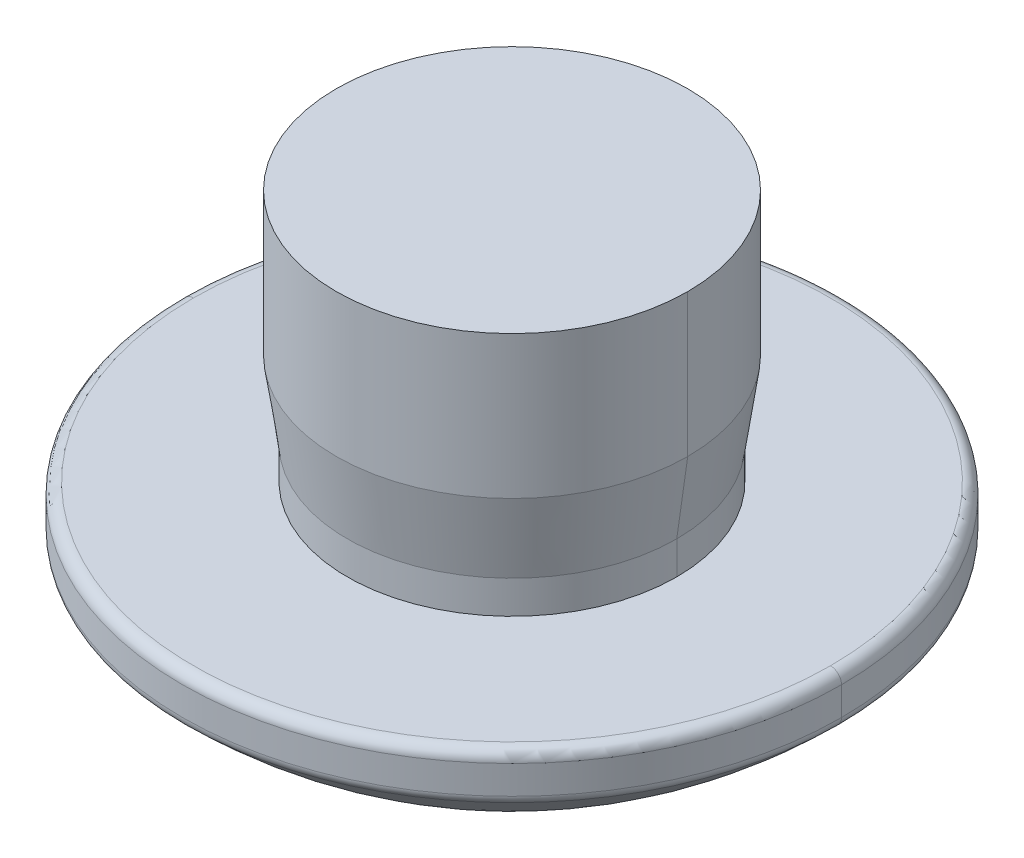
ISO-10303-21;
HEADER;
FILE_DESCRIPTION(('STEP AP214'),'2;1');
FILE_NAME('part.step','',(''),(''),'','','');
FILE_SCHEMA(('AUTOMOTIVE_DESIGN { 1 0 10303 214 1 1 1 1 }'));
ENDSEC;
DATA;
#1=APPLICATION_CONTEXT('core data for automotive mechanical design processes');
#2=APPLICATION_PROTOCOL_DEFINITION('international standard','automotive_design',2000,#1);
#3=PRODUCT_CONTEXT('',#1,'mechanical');
#4=PRODUCT('Part','Part','',(#3));
#5=PRODUCT_RELATED_PRODUCT_CATEGORY('part','',(#4));
#6=PRODUCT_DEFINITION_FORMATION('','',#4);
#7=PRODUCT_DEFINITION_CONTEXT('part definition',#1,'design');
#8=PRODUCT_DEFINITION('design','',#6,#7);
#9=PRODUCT_DEFINITION_SHAPE('','',#8);
#10=(LENGTH_UNIT() NAMED_UNIT(*) SI_UNIT(.MILLI.,.METRE.));
#11=(NAMED_UNIT(*) PLANE_ANGLE_UNIT() SI_UNIT($,.RADIAN.));
#12=(NAMED_UNIT(*) SI_UNIT($,.STERADIAN.) SOLID_ANGLE_UNIT());
#13=UNCERTAINTY_MEASURE_WITH_UNIT(LENGTH_MEASURE(1.E-05),#10,'distance_accuracy_value','');
#14=(GEOMETRIC_REPRESENTATION_CONTEXT(3) GLOBAL_UNCERTAINTY_ASSIGNED_CONTEXT((#13)) GLOBAL_UNIT_ASSIGNED_CONTEXT((#10,
#11,#12)) REPRESENTATION_CONTEXT('',''));
#15=CARTESIAN_POINT('',(0.,0.,0.));
#16=DIRECTION('',(0.,0.,1.));
#17=DIRECTION('',(1.,0.,0.));
#18=AXIS2_PLACEMENT_3D('',#15,#16,#17);
#19=CARTESIAN_POINT('',(16.8911017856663,13.2171733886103,17.2699844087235));
#20=DIRECTION('',(0.,-1.,0.));
#21=DIRECTION('',(-1.,0.,0.));
#22=AXIS2_PLACEMENT_3D('',#19,#20,#21);
#23=TOROIDAL_SURFACE('',#22,2.10103469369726,0.5);
#24=CARTESIAN_POINT('',(18.9921364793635,13.2171733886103,17.2699844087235));
#25=DIRECTION('',(0.,0.,-1.));
#26=DIRECTION('',(1.,0.,0.));
#27=AXIS2_PLACEMENT_3D('',#24,#25,#26);
#28=CIRCLE('',#27,0.5);
#29=CARTESIAN_POINT('',(19.2738215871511,12.8040711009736,17.2699844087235));
#30=VERTEX_POINT('',#29);
#31=CARTESIAN_POINT('',(18.9921364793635,12.7171733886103,17.2699844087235));
#32=VERTEX_POINT('',#31);
#33=EDGE_CURVE('E156',#30,#32,#28,.T.);
#34=ORIENTED_EDGE('',*,*,#33,.F.);
#35=CARTESIAN_POINT('',(16.8911017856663,12.8040711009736,17.2699844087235));
#36=DIRECTION('',(0.,1.,0.));
#37=DIRECTION('',(1.,0.,0.));
#38=AXIS2_PLACEMENT_3D('',#35,#36,#37);
#39=CIRCLE('',#38,2.38271980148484);
#40=CARTESIAN_POINT('',(16.8911017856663,12.8040711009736,19.6527042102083));
#41=VERTEX_POINT('',#40);
#42=EDGE_CURVE('E19',#41,#30,#39,.T.);
#43=ORIENTED_EDGE('',*,*,#42,.F.);
#44=CARTESIAN_POINT('',(16.8911017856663,12.8040711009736,17.2699844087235));
#45=DIRECTION('',(0.,1.,0.));
#46=DIRECTION('',(1.,0.,0.));
#47=AXIS2_PLACEMENT_3D('',#44,#45,#46);
#48=CIRCLE('',#47,2.38271980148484);
#49=CARTESIAN_POINT('',(14.5083819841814,12.8040711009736,17.2699844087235));
#50=VERTEX_POINT('',#49);
#51=EDGE_CURVE('E250',#50,#41,#48,.T.);
#52=ORIENTED_EDGE('',*,*,#51,.F.);
#53=CARTESIAN_POINT('',(14.790067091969,13.2171733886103,17.2699844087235));
#54=DIRECTION('',(0.,0.,1.));
#55=DIRECTION('',(0.,1.,0.));
#56=AXIS2_PLACEMENT_3D('',#53,#54,#55);
#57=CIRCLE('',#56,0.5);
#58=CARTESIAN_POINT('',(14.790067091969,12.7171733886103,17.2699844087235));
#59=VERTEX_POINT('',#58);
#60=EDGE_CURVE('E184',#50,#59,#57,.T.);
#61=ORIENTED_EDGE('',*,*,#60,.T.);
#62=CARTESIAN_POINT('',(16.8911017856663,12.7171733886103,17.2699844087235));
#63=DIRECTION('',(0.,-1.,0.));
#64=DIRECTION('',(-1.,0.,0.));
#65=AXIS2_PLACEMENT_3D('',#62,#63,#64);
#66=CIRCLE('',#65,2.10103469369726);
#67=EDGE_CURVE('E158',#32,#59,#66,.T.);
#68=ORIENTED_EDGE('',*,*,#67,.F.);
#69=EDGE_LOOP('',(#34,#43,#52,#61,#68));
#70=FACE_BOUND('',#69,.T.);
#71=ADVANCED_FACE('F16',(#70),#23,.T.);
#72=CARTESIAN_POINT('',(16.8911017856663,13.7171733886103,17.2699844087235));
#73=DIRECTION('',(0.,-1.,0.));
#74=DIRECTION('',(0.,0.,-1.));
#75=AXIS2_PLACEMENT_3D('',#72,#73,#74);
#76=PLANE('',#75);
#77=CARTESIAN_POINT('',(16.8911017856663,13.7171733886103,17.2699844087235));
#78=DIRECTION('',(0.,-1.,0.));
#79=DIRECTION('',(-1.,0.,0.));
#80=AXIS2_PLACEMENT_3D('',#77,#78,#79);
#81=CIRCLE('',#80,1.);
#82=CARTESIAN_POINT('',(15.8911017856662,13.7171733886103,17.2699844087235));
#83=VERTEX_POINT('',#82);
#84=CARTESIAN_POINT('',(17.8911017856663,13.7171733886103,17.2699844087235));
#85=VERTEX_POINT('',#84);
#86=EDGE_CURVE('E11',#83,#85,#81,.T.);
#87=ORIENTED_EDGE('',*,*,#86,.T.);
#88=CARTESIAN_POINT('',(16.8911017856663,13.7171733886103,17.2699844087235));
#89=DIRECTION('',(0.,-1.,0.));
#90=DIRECTION('',(-1.,0.,0.));
#91=AXIS2_PLACEMENT_3D('',#88,#89,#90);
#92=CIRCLE('',#91,1.);
#93=EDGE_CURVE('E202',#85,#83,#92,.T.);
#94=ORIENTED_EDGE('',*,*,#93,.T.);
#95=EDGE_LOOP('',(#87,#94));
#96=FACE_BOUND('',#95,.T.);
#97=ADVANCED_FACE('F343',(#96),#76,.T.);
#98=CARTESIAN_POINT('',(16.8911017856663,13.7171733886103,17.2699844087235));
#99=DIRECTION('',(0.,-1.,0.));
#100=DIRECTION('',(-1.,0.,0.));
#101=AXIS2_PLACEMENT_3D('',#98,#99,#100);
#102=CYLINDRICAL_SURFACE('',#101,1.);
#103=DIRECTION('',(0.,-1.,0.));
#104=VECTOR('',#103,1.);
#105=CARTESIAN_POINT('',(17.8911017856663,13.7171733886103,17.2699844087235));
#106=LINE('',#105,#104);
#107=CARTESIAN_POINT('',(17.8911017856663,12.7171733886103,17.2699844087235));
#108=VERTEX_POINT('',#107);
#109=EDGE_CURVE('E206',#85,#108,#106,.T.);
#110=ORIENTED_EDGE('',*,*,#109,.F.);
#111=ORIENTED_EDGE('',*,*,#86,.F.);
#112=DIRECTION('',(0.,-1.,0.));
#113=VECTOR('',#112,1.);
#114=CARTESIAN_POINT('',(15.8911017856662,13.7171733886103,17.2699844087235));
#115=LINE('',#114,#113);
#116=CARTESIAN_POINT('',(15.8911017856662,12.7171733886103,17.2699844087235));
#117=VERTEX_POINT('',#116);
#118=EDGE_CURVE('E223',#83,#117,#115,.T.);
#119=ORIENTED_EDGE('',*,*,#118,.T.);
#120=CARTESIAN_POINT('',(16.8911017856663,12.7171733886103,17.2699844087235));
#121=DIRECTION('',(0.,-1.,0.));
#122=DIRECTION('',(-1.,0.,0.));
#123=AXIS2_PLACEMENT_3D('',#120,#121,#122);
#124=CIRCLE('',#123,1.);
#125=EDGE_CURVE('E310',#117,#108,#124,.T.);
#126=ORIENTED_EDGE('',*,*,#125,.T.);
#127=EDGE_LOOP('',(#110,#111,#119,#126));
#128=FACE_BOUND('',#127,.T.);
#129=ADVANCED_FACE('F347',(#128),#102,.F.);
#130=CARTESIAN_POINT('',(16.8911017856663,13.6171733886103,17.2699844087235));
#131=DIRECTION('',(0.,1.,0.));
#132=DIRECTION('',(1.,0.,0.));
#133=AXIS2_PLACEMENT_3D('',#130,#131,#132);
#134=TOROIDAL_SURFACE('',#133,2.9,0.1);
#135=CARTESIAN_POINT('',(13.9911017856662,13.6171733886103,17.2699844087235));
#136=DIRECTION('',(0.,0.,-1.));
#137=DIRECTION('',(1.,0.,0.));
#138=AXIS2_PLACEMENT_3D('',#135,#136,#137);
#139=CIRCLE('',#138,0.1);
#140=CARTESIAN_POINT('',(13.8911017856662,13.6171733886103,17.2699844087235));
#141=VERTEX_POINT('',#140);
#142=CARTESIAN_POINT('',(13.9911017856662,13.7171733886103,17.2699844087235));
#143=VERTEX_POINT('',#142);
#144=EDGE_CURVE('E185',#141,#143,#139,.T.);
#145=ORIENTED_EDGE('',*,*,#144,.F.);
#146=CARTESIAN_POINT('',(16.8911017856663,13.6171733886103,17.2699844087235));
#147=DIRECTION('',(0.,-1.,0.));
#148=DIRECTION('',(1.,0.,0.));
#149=AXIS2_PLACEMENT_3D('',#146,#147,#148);
#150=CIRCLE('',#149,3.);
#151=CARTESIAN_POINT('',(19.8911017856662,13.6171733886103,17.2699844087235));
#152=VERTEX_POINT('',#151);
#153=EDGE_CURVE('E297',#152,#141,#150,.T.);
#154=ORIENTED_EDGE('',*,*,#153,.F.);
#155=CARTESIAN_POINT('',(19.7911017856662,13.6171733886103,17.2699844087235));
#156=DIRECTION('',(0.,0.,1.));
#157=DIRECTION('',(0.,1.,0.));
#158=AXIS2_PLACEMENT_3D('',#155,#156,#157);
#159=CIRCLE('',#158,0.1);
#160=CARTESIAN_POINT('',(19.7911017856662,13.7171733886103,17.2699844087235));
#161=VERTEX_POINT('',#160);
#162=EDGE_CURVE('E177',#152,#161,#159,.T.);
#163=ORIENTED_EDGE('',*,*,#162,.T.);
#164=CARTESIAN_POINT('',(16.8911017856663,13.7171733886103,17.2699844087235));
#165=DIRECTION('',(0.,1.,0.));
#166=DIRECTION('',(1.,0.,0.));
#167=AXIS2_PLACEMENT_3D('',#164,#165,#166);
#168=CIRCLE('',#167,2.9);
#169=EDGE_CURVE('E207',#143,#161,#168,.T.);
#170=ORIENTED_EDGE('',*,*,#169,.F.);
#171=EDGE_LOOP('',(#145,#154,#163,#170));
#172=FACE_BOUND('',#171,.T.);
#173=ADVANCED_FACE('F353',(#172),#134,.T.);
#174=CARTESIAN_POINT('',(16.8911017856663,13.3587004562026,17.2699844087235));
#175=DIRECTION('',(0.,1.,0.));
#176=DIRECTION('',(1.,0.,0.));
#177=AXIS2_PLACEMENT_3D('',#174,#175,#176);
#178=TOROIDAL_SURFACE('',#177,2.9,0.1);
#179=CARTESIAN_POINT('',(13.9911017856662,13.3587004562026,17.2699844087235));
#180=DIRECTION('',(0.,0.,-1.));
#181=DIRECTION('',(1.,0.,0.));
#182=AXIS2_PLACEMENT_3D('',#179,#180,#181);
#183=CIRCLE('',#182,0.1);
#184=CARTESIAN_POINT('',(13.9208737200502,13.2875104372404,17.2699844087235));
#185=VERTEX_POINT('',#184);
#186=CARTESIAN_POINT('',(13.8911017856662,13.3587004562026,17.2699844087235));
#187=VERTEX_POINT('',#186);
#188=EDGE_CURVE('E215',#185,#187,#183,.T.);
#189=ORIENTED_EDGE('',*,*,#188,.F.);
#190=CARTESIAN_POINT('',(16.8911017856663,13.2875104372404,17.2699844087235));
#191=DIRECTION('',(0.,-1.,0.));
#192=DIRECTION('',(1.,0.,0.));
#193=AXIS2_PLACEMENT_3D('',#190,#191,#192);
#194=CIRCLE('',#193,2.97022806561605);
#195=CARTESIAN_POINT('',(16.8911017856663,13.2875104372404,20.2402124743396));
#196=VERTEX_POINT('',#195);
#197=EDGE_CURVE('E244',#196,#185,#194,.T.);
#198=ORIENTED_EDGE('',*,*,#197,.F.);
#199=CARTESIAN_POINT('',(16.8911017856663,13.2875104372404,17.2699844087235));
#200=DIRECTION('',(0.,-1.,0.));
#201=DIRECTION('',(1.,0.,0.));
#202=AXIS2_PLACEMENT_3D('',#199,#200,#201);
#203=CIRCLE('',#202,2.97022806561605);
#204=CARTESIAN_POINT('',(19.8613298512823,13.2875104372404,17.2699844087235));
#205=VERTEX_POINT('',#204);
#206=EDGE_CURVE('E154',#205,#196,#203,.T.);
#207=ORIENTED_EDGE('',*,*,#206,.F.);
#208=CARTESIAN_POINT('',(19.7911017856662,13.3587004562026,17.2699844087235));
#209=DIRECTION('',(0.,0.,1.));
#210=DIRECTION('',(0.,1.,0.));
#211=AXIS2_PLACEMENT_3D('',#208,#209,#210);
#212=CIRCLE('',#211,0.1);
#213=CARTESIAN_POINT('',(19.8911017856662,13.3587004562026,17.2699844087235));
#214=VERTEX_POINT('',#213);
#215=EDGE_CURVE('E236',#205,#214,#212,.T.);
#216=ORIENTED_EDGE('',*,*,#215,.T.);
#217=CARTESIAN_POINT('',(16.8911017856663,13.3587004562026,17.2699844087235));
#218=DIRECTION('',(0.,1.,0.));
#219=DIRECTION('',(1.,0.,0.));
#220=AXIS2_PLACEMENT_3D('',#217,#218,#219);
#221=CIRCLE('',#220,3.);
#222=EDGE_CURVE('E210',#187,#214,#221,.T.);
#223=ORIENTED_EDGE('',*,*,#222,.F.);
#224=EDGE_LOOP('',(#189,#198,#207,#216,#223));
#225=FACE_BOUND('',#224,.T.);
#226=ADVANCED_FACE('F320',(#225),#178,.T.);
#227=CARTESIAN_POINT('',(16.8911017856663,16.2984233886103,17.2699844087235));
#228=DIRECTION('',(-1.,0.,0.));
#229=DIRECTION('',(0.,0.,1.));
#230=AXIS2_PLACEMENT_3D('',#227,#228,#229);
#231=SPHERICAL_SURFACE('',#230,4.22940321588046);
#232=CARTESIAN_POINT('',(16.8911017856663,16.2984233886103,17.2699844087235));
#233=DIRECTION('',(-1.,0.,0.));
#234=DIRECTION('',(0.,0.,-1.));
#235=AXIS2_PLACEMENT_3D('',#232,#233,#234);
#236=CIRCLE('',#235,4.22940321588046);
#237=CARTESIAN_POINT('',(16.8911017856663,13.2875104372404,14.2997563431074));
#238=VERTEX_POINT('',#237);
#239=CARTESIAN_POINT('',(16.8911017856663,12.8040711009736,14.8872646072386));
#240=VERTEX_POINT('',#239);
#241=EDGE_CURVE('E247',#238,#240,#236,.T.);
#242=ORIENTED_EDGE('',*,*,#241,.F.);
#243=CARTESIAN_POINT('',(16.8911017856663,13.2875104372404,17.2699844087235));
#244=DIRECTION('',(0.,-1.,0.));
#245=DIRECTION('',(1.,0.,0.));
#246=AXIS2_PLACEMENT_3D('',#243,#244,#245);
#247=CIRCLE('',#246,2.97022806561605);
#248=EDGE_CURVE('E239',#238,#205,#247,.T.);
#249=ORIENTED_EDGE('',*,*,#248,.T.);
#250=ORIENTED_EDGE('',*,*,#206,.T.);
#251=CARTESIAN_POINT('',(16.8911017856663,16.2984233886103,17.2699844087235));
#252=DIRECTION('',(1.,0.,0.));
#253=DIRECTION('',(0.,-1.,0.));
#254=AXIS2_PLACEMENT_3D('',#251,#252,#253);
#255=CIRCLE('',#254,4.22940321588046);
#256=EDGE_CURVE('E150',#196,#41,#255,.T.);
#257=ORIENTED_EDGE('',*,*,#256,.T.);
#258=ORIENTED_EDGE('',*,*,#42,.T.);
#259=CARTESIAN_POINT('',(16.8911017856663,12.8040711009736,17.2699844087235));
#260=DIRECTION('',(0.,1.,0.));
#261=DIRECTION('',(1.,0.,0.));
#262=AXIS2_PLACEMENT_3D('',#259,#260,#261);
#263=CIRCLE('',#262,2.38271980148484);
#264=EDGE_CURVE('E148',#30,#240,#263,.T.);
#265=ORIENTED_EDGE('',*,*,#264,.T.);
#266=EDGE_LOOP('',(#242,#249,#250,#257,#258,#265));
#267=FACE_BOUND('',#266,.T.);
#268=ADVANCED_FACE('F146',(#267),#231,.T.);
#269=CARTESIAN_POINT('',(16.8911017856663,12.7171733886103,17.2699844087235));
#270=DIRECTION('',(0.,-1.,0.));
#271=DIRECTION('',(0.,0.,-1.));
#272=AXIS2_PLACEMENT_3D('',#269,#270,#271);
#273=PLANE('',#272);
#274=ORIENTED_EDGE('',*,*,#125,.F.);
#275=CARTESIAN_POINT('',(16.8911017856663,12.7171733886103,17.2699844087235));
#276=DIRECTION('',(0.,-1.,0.));
#277=DIRECTION('',(-1.,0.,0.));
#278=AXIS2_PLACEMENT_3D('',#275,#276,#277);
#279=CIRCLE('',#278,1.);
#280=EDGE_CURVE('E214',#108,#117,#279,.T.);
#281=ORIENTED_EDGE('',*,*,#280,.F.);
#282=EDGE_LOOP('',(#274,#281));
#283=FACE_BOUND('',#282,.T.);
#284=CARTESIAN_POINT('',(16.8911017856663,12.7171733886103,17.2699844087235));
#285=DIRECTION('',(0.,-1.,0.));
#286=DIRECTION('',(-1.,0.,0.));
#287=AXIS2_PLACEMENT_3D('',#284,#285,#286);
#288=CIRCLE('',#287,2.10103469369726);
#289=EDGE_CURVE('E163',#59,#32,#288,.T.);
#290=ORIENTED_EDGE('',*,*,#289,.T.);
#291=ORIENTED_EDGE('',*,*,#67,.T.);
#292=EDGE_LOOP('',(#290,#291));
#293=FACE_BOUND('',#292,.T.);
#294=ADVANCED_FACE('F327',(#283,#293),#273,.T.);
#295=CARTESIAN_POINT('',(16.8911017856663,16.0171733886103,18.8699844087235));
#296=DIRECTION('',(0.,1.,0.));
#297=DIRECTION('',(0.,0.,1.));
#298=AXIS2_PLACEMENT_3D('',#295,#296,#297);
#299=PLANE('',#298);
#300=CARTESIAN_POINT('',(16.8911017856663,16.0171733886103,17.2699844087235));
#301=DIRECTION('',(0.,-1.,0.));
#302=DIRECTION('',(-1.,0.,0.));
#303=AXIS2_PLACEMENT_3D('',#300,#301,#302);
#304=CIRCLE('',#303,1.6);
#305=CARTESIAN_POINT('',(15.2911017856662,16.0171733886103,17.2699844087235));
#306=VERTEX_POINT('',#305);
#307=CARTESIAN_POINT('',(18.4911017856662,16.0171733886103,17.2699844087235));
#308=VERTEX_POINT('',#307);
#309=EDGE_CURVE('E255',#306,#308,#304,.T.);
#310=ORIENTED_EDGE('',*,*,#309,.F.);
#311=CARTESIAN_POINT('',(16.8911017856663,16.0171733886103,17.2699844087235));
#312=DIRECTION('',(0.,-1.,0.));
#313=DIRECTION('',(-1.,0.,0.));
#314=AXIS2_PLACEMENT_3D('',#311,#312,#313);
#315=CIRCLE('',#314,1.6);
#316=EDGE_CURVE('E195',#308,#306,#315,.T.);
#317=ORIENTED_EDGE('',*,*,#316,.F.);
#318=EDGE_LOOP('',(#310,#317));
#319=FACE_BOUND('',#318,.T.);
#320=ADVANCED_FACE('F329',(#319),#299,.T.);
#321=CARTESIAN_POINT('',(16.8911017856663,6.31955303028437,17.2699844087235));
#322=DIRECTION('',(0.,-1.,0.));
#323=DIRECTION('',(-1.,0.,0.));
#324=AXIS2_PLACEMENT_3D('',#321,#322,#323);
#325=CYLINDRICAL_SURFACE('',#324,1.6);
#326=DIRECTION('',(0.,-1.,0.));
#327=VECTOR('',#326,1.);
#328=CARTESIAN_POINT('',(18.4911017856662,6.31955303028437,17.2699844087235));
#329=LINE('',#328,#327);
#330=CARTESIAN_POINT('',(18.4911017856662,14.7171733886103,17.2699844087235));
#331=VERTEX_POINT('',#330);
#332=EDGE_CURVE('E259',#308,#331,#329,.T.);
#333=ORIENTED_EDGE('',*,*,#332,.F.);
#334=ORIENTED_EDGE('',*,*,#316,.T.);
#335=DIRECTION('',(0.,-1.,0.));
#336=VECTOR('',#335,1.);
#337=CARTESIAN_POINT('',(15.2911017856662,6.31955303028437,17.2699844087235));
#338=LINE('',#337,#336);
#339=CARTESIAN_POINT('',(15.2911017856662,14.7171733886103,17.2699844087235));
#340=VERTEX_POINT('',#339);
#341=EDGE_CURVE('E267',#306,#340,#338,.T.);
#342=ORIENTED_EDGE('',*,*,#341,.T.);
#343=CARTESIAN_POINT('',(16.8911017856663,14.7171733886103,17.2699844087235));
#344=DIRECTION('',(0.,-1.,0.));
#345=DIRECTION('',(-1.,0.,0.));
#346=AXIS2_PLACEMENT_3D('',#343,#344,#345);
#347=CIRCLE('',#346,1.6);
#348=EDGE_CURVE('E192',#331,#340,#347,.T.);
#349=ORIENTED_EDGE('',*,*,#348,.F.);
#350=EDGE_LOOP('',(#333,#334,#342,#349));
#351=FACE_BOUND('',#350,.T.);
#352=ADVANCED_FACE('F337',(#351),#325,.T.);
#353=CARTESIAN_POINT('',(16.8911017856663,14.0171733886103,17.2699844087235));
#354=DIRECTION('',(0.,1.,0.));
#355=DIRECTION('',(1.,0.,0.));
#356=AXIS2_PLACEMENT_3D('',#353,#354,#355);
#357=CONICAL_SURFACE('',#356,1.5,0.141897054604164);
#358=DIRECTION('',(-0.141421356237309,0.989949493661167,0.));
#359=VECTOR('',#358,1.);
#360=CARTESIAN_POINT('',(15.3911017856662,14.0171733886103,17.2699844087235));
#361=LINE('',#360,#359);
#362=CARTESIAN_POINT('',(15.3911017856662,14.0171733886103,17.2699844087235));
#363=VERTEX_POINT('',#362);
#364=EDGE_CURVE('E275',#363,#340,#361,.T.);
#365=ORIENTED_EDGE('',*,*,#364,.F.);
#366=CARTESIAN_POINT('',(16.8911017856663,14.0171733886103,17.2699844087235));
#367=DIRECTION('',(0.,-1.,0.));
#368=DIRECTION('',(-1.,0.,0.));
#369=AXIS2_PLACEMENT_3D('',#366,#367,#368);
#370=CIRCLE('',#369,1.5);
#371=CARTESIAN_POINT('',(18.3911017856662,14.0171733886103,17.2699844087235));
#372=VERTEX_POINT('',#371);
#373=EDGE_CURVE('E196',#372,#363,#370,.T.);
#374=ORIENTED_EDGE('',*,*,#373,.F.);
#375=DIRECTION('',(0.141421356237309,0.989949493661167,0.));
#376=VECTOR('',#375,1.);
#377=CARTESIAN_POINT('',(18.3911017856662,14.0171733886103,17.2699844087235));
#378=LINE('',#377,#376);
#379=EDGE_CURVE('E279',#372,#331,#378,.T.);
#380=ORIENTED_EDGE('',*,*,#379,.T.);
#381=ORIENTED_EDGE('',*,*,#348,.T.);
#382=EDGE_LOOP('',(#365,#374,#380,#381));
#383=FACE_BOUND('',#382,.T.);
#384=ADVANCED_FACE('F368',(#383),#357,.T.);
#385=CARTESIAN_POINT('',(16.8911017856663,6.31955303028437,17.2699844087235));
#386=DIRECTION('',(0.,-1.,0.));
#387=DIRECTION('',(-1.,0.,0.));
#388=AXIS2_PLACEMENT_3D('',#385,#386,#387);
#389=CYLINDRICAL_SURFACE('',#388,1.5);
#390=DIRECTION('',(0.,-1.,0.));
#391=VECTOR('',#390,1.);
#392=CARTESIAN_POINT('',(18.3911017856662,6.31955303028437,17.2699844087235));
#393=LINE('',#392,#391);
#394=CARTESIAN_POINT('',(18.3911017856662,13.7171733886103,17.2699844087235));
#395=VERTEX_POINT('',#394);
#396=EDGE_CURVE('E283',#372,#395,#393,.T.);
#397=ORIENTED_EDGE('',*,*,#396,.F.);
#398=ORIENTED_EDGE('',*,*,#373,.T.);
#399=DIRECTION('',(0.,-1.,0.));
#400=VECTOR('',#399,1.);
#401=CARTESIAN_POINT('',(15.3911017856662,6.31955303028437,17.2699844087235));
#402=LINE('',#401,#400);
#403=CARTESIAN_POINT('',(15.3911017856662,13.7171733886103,17.2699844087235));
#404=VERTEX_POINT('',#403);
#405=EDGE_CURVE('E290',#363,#404,#402,.T.);
#406=ORIENTED_EDGE('',*,*,#405,.T.);
#407=CARTESIAN_POINT('',(16.8911017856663,13.7171733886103,17.2699844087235));
#408=DIRECTION('',(0.,-1.,0.));
#409=DIRECTION('',(-1.,0.,0.));
#410=AXIS2_PLACEMENT_3D('',#407,#408,#409);
#411=CIRCLE('',#410,1.5);
#412=EDGE_CURVE('E34',#395,#404,#411,.T.);
#413=ORIENTED_EDGE('',*,*,#412,.F.);
#414=EDGE_LOOP('',(#397,#398,#406,#413));
#415=FACE_BOUND('',#414,.T.);
#416=ADVANCED_FACE('F378',(#415),#389,.T.);
#417=CARTESIAN_POINT('',(16.8911017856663,13.7171733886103,18.7699844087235));
#418=DIRECTION('',(0.,1.,0.));
#419=DIRECTION('',(0.,0.,1.));
#420=AXIS2_PLACEMENT_3D('',#417,#418,#419);
#421=PLANE('',#420);
#422=CARTESIAN_POINT('',(16.8911017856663,13.7171733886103,17.2699844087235));
#423=DIRECTION('',(0.,-1.,0.));
#424=DIRECTION('',(-1.,0.,0.));
#425=AXIS2_PLACEMENT_3D('',#422,#423,#424);
#426=CIRCLE('',#425,1.5);
#427=EDGE_CURVE('E287',#404,#395,#426,.T.);
#428=ORIENTED_EDGE('',*,*,#427,.T.);
#429=ORIENTED_EDGE('',*,*,#412,.T.);
#430=EDGE_LOOP('',(#428,#429));
#431=FACE_BOUND('',#430,.T.);
#432=CARTESIAN_POINT('',(16.8911017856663,13.7171733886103,17.2699844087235));
#433=DIRECTION('',(0.,1.,0.));
#434=DIRECTION('',(1.,0.,0.));
#435=AXIS2_PLACEMENT_3D('',#432,#433,#434);
#436=CIRCLE('',#435,2.9);
#437=EDGE_CURVE('E180',#161,#143,#436,.T.);
#438=ORIENTED_EDGE('',*,*,#437,.T.);
#439=ORIENTED_EDGE('',*,*,#169,.T.);
#440=EDGE_LOOP('',(#438,#439));
#441=FACE_BOUND('',#440,.T.);
#442=ADVANCED_FACE('F374',(#431,#441),#421,.T.);
#443=CARTESIAN_POINT('',(16.8911017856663,6.31955303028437,17.2699844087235));
#444=DIRECTION('',(0.,-1.,0.));
#445=DIRECTION('',(-1.,0.,0.));
#446=AXIS2_PLACEMENT_3D('',#443,#444,#445);
#447=CYLINDRICAL_SURFACE('',#446,3.);
#448=DIRECTION('',(0.,-1.,0.));
#449=VECTOR('',#448,1.);
#450=CARTESIAN_POINT('',(19.8911017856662,6.31955303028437,17.2699844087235));
#451=LINE('',#450,#449);
#452=EDGE_CURVE('E293',#152,#214,#451,.T.);
#453=ORIENTED_EDGE('',*,*,#452,.F.);
#454=ORIENTED_EDGE('',*,*,#153,.T.);
#455=DIRECTION('',(0.,-1.,0.));
#456=VECTOR('',#455,1.);
#457=CARTESIAN_POINT('',(13.8911017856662,6.31955303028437,17.2699844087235));
#458=LINE('',#457,#456);
#459=EDGE_CURVE('E176',#141,#187,#458,.T.);
#460=ORIENTED_EDGE('',*,*,#459,.T.);
#461=ORIENTED_EDGE('',*,*,#222,.T.);
#462=EDGE_LOOP('',(#453,#454,#460,#461));
#463=FACE_BOUND('',#462,.T.);
#464=ADVANCED_FACE('F377',(#463),#447,.T.);
#465=CARTESIAN_POINT('',(16.8911017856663,6.31955303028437,17.2699844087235));
#466=DIRECTION('',(0.,-1.,0.));
#467=DIRECTION('',(-1.,0.,0.));
#468=AXIS2_PLACEMENT_3D('',#465,#466,#467);
#469=CYLINDRICAL_SURFACE('',#468,3.);
#470=CARTESIAN_POINT('',(16.8911017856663,13.6171733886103,17.2699844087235));
#471=DIRECTION('',(0.,-1.,0.));
#472=DIRECTION('',(1.,0.,0.));
#473=AXIS2_PLACEMENT_3D('',#470,#471,#472);
#474=CIRCLE('',#473,3.);
#475=EDGE_CURVE('E189',#141,#152,#474,.T.);
#476=ORIENTED_EDGE('',*,*,#475,.T.);
#477=ORIENTED_EDGE('',*,*,#452,.T.);
#478=CARTESIAN_POINT('',(16.8911017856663,13.3587004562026,17.2699844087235));
#479=DIRECTION('',(0.,1.,0.));
#480=DIRECTION('',(1.,0.,0.));
#481=AXIS2_PLACEMENT_3D('',#478,#479,#480);
#482=CIRCLE('',#481,3.);
#483=EDGE_CURVE('E219',#214,#187,#482,.T.);
#484=ORIENTED_EDGE('',*,*,#483,.T.);
#485=ORIENTED_EDGE('',*,*,#459,.F.);
#486=EDGE_LOOP('',(#476,#477,#484,#485));
#487=FACE_BOUND('',#486,.T.);
#488=ADVANCED_FACE('F372',(#487),#469,.T.);
#489=CARTESIAN_POINT('',(16.8911017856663,6.31955303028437,17.2699844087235));
#490=DIRECTION('',(0.,-1.,0.));
#491=DIRECTION('',(-1.,0.,0.));
#492=AXIS2_PLACEMENT_3D('',#489,#490,#491);
#493=CYLINDRICAL_SURFACE('',#492,1.5);
#494=CARTESIAN_POINT('',(16.8911017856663,14.0171733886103,17.2699844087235));
#495=DIRECTION('',(0.,-1.,0.));
#496=DIRECTION('',(-1.,0.,0.));
#497=AXIS2_PLACEMENT_3D('',#494,#495,#496);
#498=CIRCLE('',#497,1.5);
#499=EDGE_CURVE('E271',#363,#372,#498,.T.);
#500=ORIENTED_EDGE('',*,*,#499,.T.);
#501=ORIENTED_EDGE('',*,*,#396,.T.);
#502=ORIENTED_EDGE('',*,*,#427,.F.);
#503=ORIENTED_EDGE('',*,*,#405,.F.);
#504=EDGE_LOOP('',(#500,#501,#502,#503));
#505=FACE_BOUND('',#504,.T.);
#506=ADVANCED_FACE('F364',(#505),#493,.T.);
#507=CARTESIAN_POINT('',(16.8911017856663,14.0171733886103,17.2699844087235));
#508=DIRECTION('',(0.,1.,0.));
#509=DIRECTION('',(1.,0.,0.));
#510=AXIS2_PLACEMENT_3D('',#507,#508,#509);
#511=CONICAL_SURFACE('',#510,1.5,0.141897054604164);
#512=ORIENTED_EDGE('',*,*,#499,.F.);
#513=ORIENTED_EDGE('',*,*,#364,.T.);
#514=CARTESIAN_POINT('',(16.8911017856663,14.7171733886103,17.2699844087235));
#515=DIRECTION('',(0.,-1.,0.));
#516=DIRECTION('',(-1.,0.,0.));
#517=AXIS2_PLACEMENT_3D('',#514,#515,#516);
#518=CIRCLE('',#517,1.6);
#519=EDGE_CURVE('E263',#340,#331,#518,.T.);
#520=ORIENTED_EDGE('',*,*,#519,.T.);
#521=ORIENTED_EDGE('',*,*,#379,.F.);
#522=EDGE_LOOP('',(#512,#513,#520,#521));
#523=FACE_BOUND('',#522,.T.);
#524=ADVANCED_FACE('F361',(#523),#511,.T.);
#525=CARTESIAN_POINT('',(16.8911017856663,6.31955303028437,17.2699844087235));
#526=DIRECTION('',(0.,-1.,0.));
#527=DIRECTION('',(-1.,0.,0.));
#528=AXIS2_PLACEMENT_3D('',#525,#526,#527);
#529=CYLINDRICAL_SURFACE('',#528,1.6);
#530=ORIENTED_EDGE('',*,*,#309,.T.);
#531=ORIENTED_EDGE('',*,*,#332,.T.);
#532=ORIENTED_EDGE('',*,*,#519,.F.);
#533=ORIENTED_EDGE('',*,*,#341,.F.);
#534=EDGE_LOOP('',(#530,#531,#532,#533));
#535=FACE_BOUND('',#534,.T.);
#536=ADVANCED_FACE('F357',(#535),#529,.T.);
#537=CARTESIAN_POINT('',(16.8911017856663,16.2984233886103,17.2699844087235));
#538=DIRECTION('',(-1.,0.,0.));
#539=DIRECTION('',(0.,0.,1.));
#540=AXIS2_PLACEMENT_3D('',#537,#538,#539);
#541=SPHERICAL_SURFACE('',#540,4.22940321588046);
#542=ORIENTED_EDGE('',*,*,#197,.T.);
#543=CARTESIAN_POINT('',(16.8911017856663,13.2875104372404,17.2699844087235));
#544=DIRECTION('',(0.,-1.,0.));
#545=DIRECTION('',(1.,0.,0.));
#546=AXIS2_PLACEMENT_3D('',#543,#544,#545);
#547=CIRCLE('',#546,2.97022806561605);
#548=EDGE_CURVE('E179',#185,#238,#547,.T.);
#549=ORIENTED_EDGE('',*,*,#548,.T.);
#550=ORIENTED_EDGE('',*,*,#241,.T.);
#551=CARTESIAN_POINT('',(16.8911017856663,12.8040711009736,17.2699844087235));
#552=DIRECTION('',(0.,1.,0.));
#553=DIRECTION('',(1.,0.,0.));
#554=AXIS2_PLACEMENT_3D('',#551,#552,#553);
#555=CIRCLE('',#554,2.38271980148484);
#556=EDGE_CURVE('E169',#240,#50,#555,.T.);
#557=ORIENTED_EDGE('',*,*,#556,.T.);
#558=ORIENTED_EDGE('',*,*,#51,.T.);
#559=ORIENTED_EDGE('',*,*,#256,.F.);
#560=EDGE_LOOP('',(#542,#549,#550,#557,#558,#559));
#561=FACE_BOUND('',#560,.T.);
#562=ADVANCED_FACE('F318',(#561),#541,.T.);
#563=CARTESIAN_POINT('',(16.8911017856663,13.3587004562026,17.2699844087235));
#564=DIRECTION('',(0.,1.,0.));
#565=DIRECTION('',(1.,0.,0.));
#566=AXIS2_PLACEMENT_3D('',#563,#564,#565);
#567=TOROIDAL_SURFACE('',#566,2.9,0.1);
#568=ORIENTED_EDGE('',*,*,#548,.F.);
#569=ORIENTED_EDGE('',*,*,#188,.T.);
#570=ORIENTED_EDGE('',*,*,#483,.F.);
#571=ORIENTED_EDGE('',*,*,#215,.F.);
#572=ORIENTED_EDGE('',*,*,#248,.F.);
#573=EDGE_LOOP('',(#568,#569,#570,#571,#572));
#574=FACE_BOUND('',#573,.T.);
#575=ADVANCED_FACE('F325',(#574),#567,.T.);
#576=CARTESIAN_POINT('',(16.8911017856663,13.6171733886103,17.2699844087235));
#577=DIRECTION('',(0.,1.,0.));
#578=DIRECTION('',(1.,0.,0.));
#579=AXIS2_PLACEMENT_3D('',#576,#577,#578);
#580=TOROIDAL_SURFACE('',#579,2.9,0.1);
#581=ORIENTED_EDGE('',*,*,#475,.F.);
#582=ORIENTED_EDGE('',*,*,#144,.T.);
#583=ORIENTED_EDGE('',*,*,#437,.F.);
#584=ORIENTED_EDGE('',*,*,#162,.F.);
#585=EDGE_LOOP('',(#581,#582,#583,#584));
#586=FACE_BOUND('',#585,.T.);
#587=ADVANCED_FACE('F401',(#586),#580,.T.);
#588=CARTESIAN_POINT('',(16.8911017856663,13.7171733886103,17.2699844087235));
#589=DIRECTION('',(0.,-1.,0.));
#590=DIRECTION('',(-1.,0.,0.));
#591=AXIS2_PLACEMENT_3D('',#588,#589,#590);
#592=CYLINDRICAL_SURFACE('',#591,1.);
#593=ORIENTED_EDGE('',*,*,#93,.F.);
#594=ORIENTED_EDGE('',*,*,#109,.T.);
#595=ORIENTED_EDGE('',*,*,#280,.T.);
#596=ORIENTED_EDGE('',*,*,#118,.F.);
#597=EDGE_LOOP('',(#593,#594,#595,#596));
#598=FACE_BOUND('',#597,.T.);
#599=ADVANCED_FACE('F524',(#598),#592,.F.);
#600=CARTESIAN_POINT('',(16.8911017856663,13.2171733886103,17.2699844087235));
#601=DIRECTION('',(0.,-1.,0.));
#602=DIRECTION('',(-1.,0.,0.));
#603=AXIS2_PLACEMENT_3D('',#600,#601,#602);
#604=TOROIDAL_SURFACE('',#603,2.10103469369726,0.5);
#605=ORIENTED_EDGE('',*,*,#264,.F.);
#606=ORIENTED_EDGE('',*,*,#33,.T.);
#607=ORIENTED_EDGE('',*,*,#289,.F.);
#608=ORIENTED_EDGE('',*,*,#60,.F.);
#609=ORIENTED_EDGE('',*,*,#556,.F.);
#610=EDGE_LOOP('',(#605,#606,#607,#608,#609));
#611=FACE_BOUND('',#610,.T.);
#612=ADVANCED_FACE('F166',(#611),#604,.T.);
#613=CLOSED_SHELL('',(#71,#97,#129,#173,#226,#268,#294,#320,#352,#384,#416,#442,#464,#488,#506,
#524,#536,#562,#575,#587,#599,#612));
#614=MANIFOLD_SOLID_BREP('B1',#613);
#615=ADVANCED_BREP_SHAPE_REPRESENTATION('',(#18,#614),#14);
#616=SHAPE_DEFINITION_REPRESENTATION(#9,#615);
ENDSEC;
END-ISO-10303-21;
